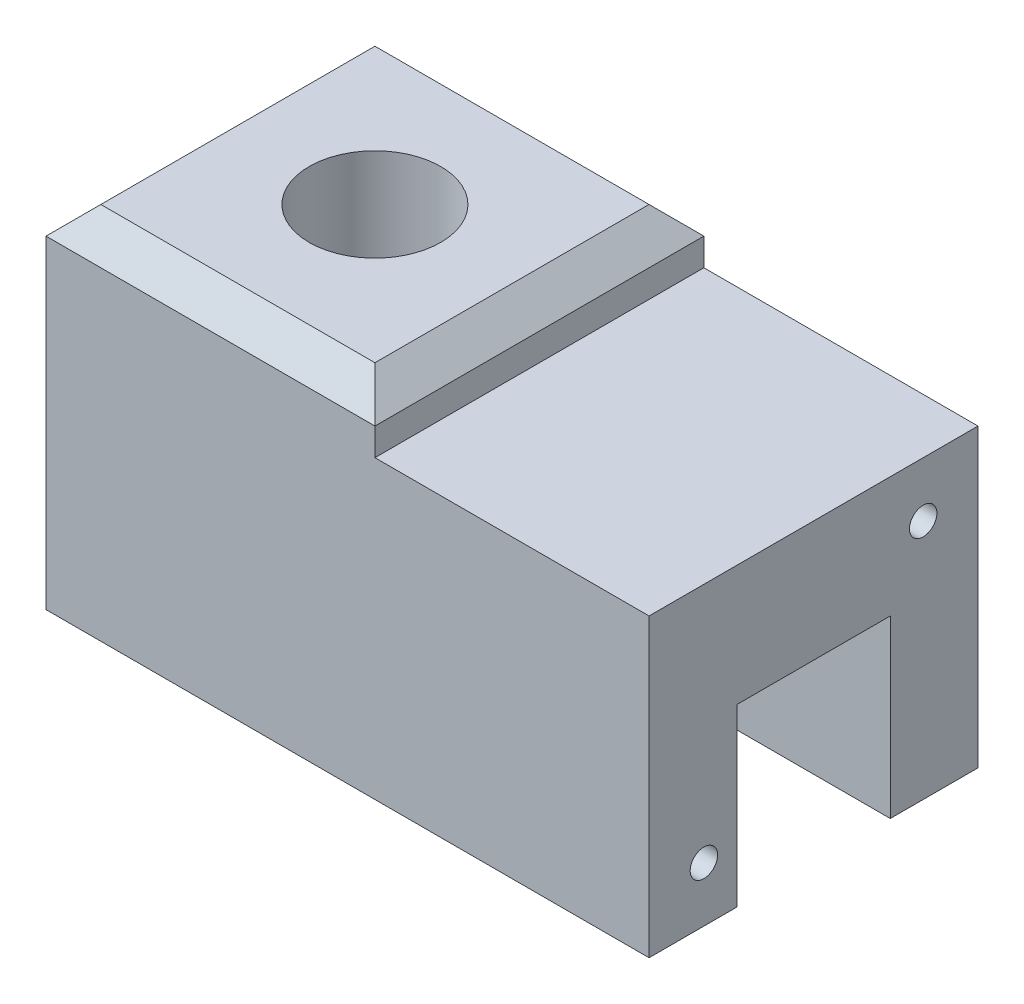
from build123d import *

# Parameters (mm, degrees)
BASE_EXTRUSION_DEPTH       = 60
CHANFREIN1_SIZE            = 5
ESQUISSE2_W                = 28
ESQUISSE2_H                = 32
ENL_V_MAT_EXTRU_1_DEPTH    = 141.698258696
ESQUISSE3_R                = 12
ENL_V_MAT_EXTRU_2_DEPTH    = 141.698258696
TROU_TARAUD_M6X1_01_D      = 5
TROU_TARAUD_M6X1_01_DEPTH  = 17
TROU_TARAUD_M6X1_01_TIP    = 1.502151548
TROU_TARAUD_M6X1_02_D      = 5
TROU_TARAUD_M6X1_02_DEPTH  = 17
TROU_TARAUD_M6X1_02_TIP    = 1.502151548
TROU_TARAUD_M8X1_251_D     = 6.75
TROU_TARAUD_M8X1_251_DEPTH = 22.25
TROU_TARAUD_M8X1_251_TIP   = 2.027904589
TROU_TARAUD_M8X1_252_D     = 6.75
TROU_TARAUD_M8X1_252_DEPTH = 28
TROU_TARAUD_M8X1_252_TIP   = 2.027904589
TROU_TARAUD_M8X1_253_D     = 6.75
TROU_TARAUD_M8X1_253_DEPTH = 28
TROU_TARAUD_M8X1_253_TIP   = 2.027904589


with BuildPart() as part:
    # Esquisse1 → Base-Extrusion (new body)
    with BuildSketch(Plane.XY):
        Polygon((0, 0), (110, 0), (110, 54), (60, 54), (60, 64), (0, 64), (0, 50), align=None)
    extrude(amount=BASE_EXTRUSION_DEPTH)

    # Chanfrein1
    chanfrein1_edges = [part.edges().sort_by_distance(p)[0] for p in [
        (0, 64, 30),
        (60, 64, 30),
        (30, 64, 60),
        (30, 64, 0),
    ]]
    chamfer(chanfrein1_edges, length=CHANFREIN1_SIZE)

    # Esquisse2 → Enl_v. mat.-Extru.1 (cut, through all)
    with BuildSketch(Plane.ZY):
        with Locations((30, 16)):
            Rectangle(ESQUISSE2_W, ESQUISSE2_H)
    extrude(amount=-ENL_V_MAT_EXTRU_1_DEPTH, mode=Mode.SUBTRACT)

    # Esquisse3 → Enl_v. mat.-Extru.2 (cut, through all)
    with BuildSketch(Plane(origin=(0, 64, 0), x_dir=(-1, 0, 0), z_dir=(0, 1, 0))):
        with Locations(Location((-30, 30, 0), (0, 0, 90))):
            Circle(ESQUISSE3_R)
    extrude(amount=-ENL_V_MAT_EXTRU_2_DEPTH, mode=Mode.SUBTRACT)

    # Trou taraud_ M6x1.01
    with Locations(Plane(origin=(110, 0, 0), x_dir=(0, 0, -1), z_dir=(1, 0, 0))):
        with Locations((-10, 44)):
            Hole(TROU_TARAUD_M6X1_01_D / 2, depth=TROU_TARAUD_M6X1_01_DEPTH)
            with Locations((0, 0, -(TROU_TARAUD_M6X1_01_DEPTH + TROU_TARAUD_M6X1_01_TIP / 2))):  # 118° drill point
                Cone(0, TROU_TARAUD_M6X1_01_D / 2, TROU_TARAUD_M6X1_01_TIP, mode=Mode.SUBTRACT)

    # Trou taraud_ M6x1.02
    with Locations(Plane(origin=(110, 0, 0), x_dir=(0, 0, -1), z_dir=(1, 0, 0))):
        with Locations((-50, 10)):
            Hole(TROU_TARAUD_M6X1_02_D / 2, depth=TROU_TARAUD_M6X1_02_DEPTH)
            with Locations((0, 0, -(TROU_TARAUD_M6X1_02_DEPTH + TROU_TARAUD_M6X1_02_TIP / 2))):  # 118° drill point
                Cone(0, TROU_TARAUD_M6X1_02_D / 2, TROU_TARAUD_M6X1_02_TIP, mode=Mode.SUBTRACT)

    # Trou taraud_ M8x1.251
    with Locations(Plane.XZ):
        with Locations((16, 52)):
            Hole(TROU_TARAUD_M8X1_251_D / 2, depth=TROU_TARAUD_M8X1_251_DEPTH)
            with Locations((0, 0, -(TROU_TARAUD_M8X1_251_DEPTH + TROU_TARAUD_M8X1_251_TIP / 2))):  # 118° drill point
                Cone(0, TROU_TARAUD_M8X1_251_D / 2, TROU_TARAUD_M8X1_251_TIP, mode=Mode.SUBTRACT)

    # Trou taraud_ M8x1.252
    with Locations(Plane.XZ):
        with Locations((94, 8)):
            Hole(TROU_TARAUD_M8X1_252_D / 2, depth=TROU_TARAUD_M8X1_252_DEPTH)
            with Locations((0, 0, -(TROU_TARAUD_M8X1_252_DEPTH + TROU_TARAUD_M8X1_252_TIP / 2))):  # 118° drill point
                Cone(0, TROU_TARAUD_M8X1_252_D / 2, TROU_TARAUD_M8X1_252_TIP, mode=Mode.SUBTRACT)

    # Trou taraud_ M8x1.253
    with Locations(Plane.XZ):
        with Locations((16, 8)):
            Hole(TROU_TARAUD_M8X1_253_D / 2, depth=TROU_TARAUD_M8X1_253_DEPTH)
            with Locations((0, 0, -(TROU_TARAUD_M8X1_253_DEPTH + TROU_TARAUD_M8X1_253_TIP / 2))):  # 118° drill point
                Cone(0, TROU_TARAUD_M8X1_253_D / 2, TROU_TARAUD_M8X1_253_TIP, mode=Mode.SUBTRACT)


solid = part.part
